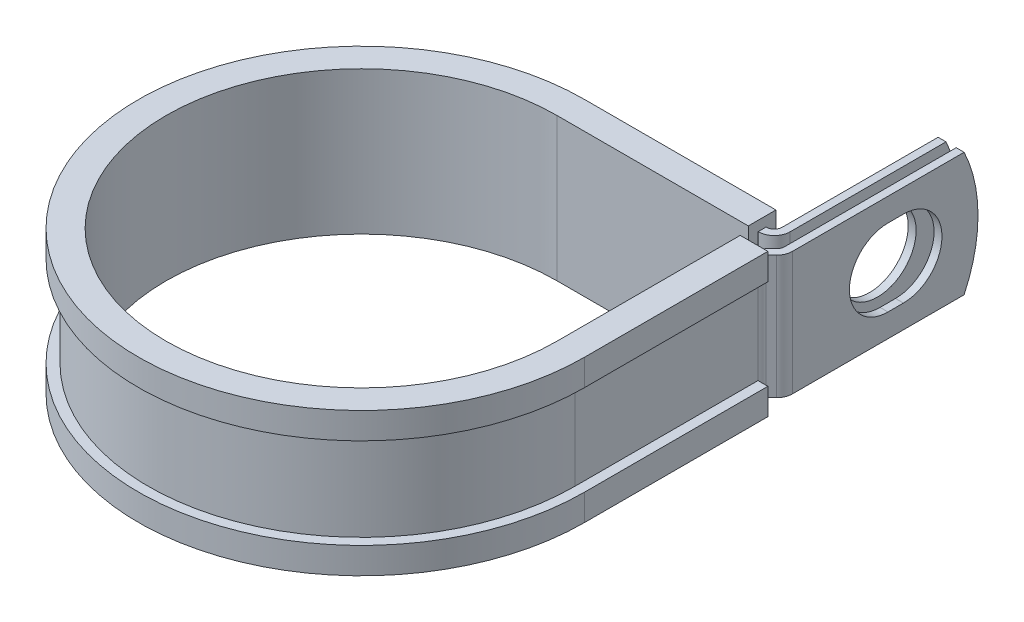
from build123d import *

# Parameters (mm, degrees)
EXTRUDE_THIN1_DEPTH = 9.525
SKETCH2_R           = 5.9436
CUT_EXTRUDE1_DEPTH  = 1.2192
CUT_EXTRUDE2_DEPTH  = 1.2192
CUT_EXTRUDE3_DEPTH  = 89.243807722


with BuildPart() as part:
    # Sketch1 → Extrude-Thin1 (new, symmetric)
    with BuildSketch(Plane(origin=(0, 0, 0), x_dir=(1, 0, 0), z_dir=(0, 1, 0))):
        with BuildLine():
            Line((33.5839698, 60.325), (33.5839698, 31.6865))
            ThreePointArc((33.5839698, 31.6865), (33.491163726, 31.219932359), (33.226874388, 30.824395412))
            Line((33.226874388, 30.824395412), (32.400690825, 29.998211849))
            ThreePointArc((32.400690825, 29.998211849), (31.872112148, 29.207137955), (31.6865, 28.274002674))
            Line((31.6865, 28.274002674), (31.6865, 0))
            ThreePointArc((31.6865, 0), (-22.405739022, -22.405739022), (0, 31.6865))
            Line((0, 31.6865), (29.5707698, 31.6865))
            ThreePointArc((29.5707698, 31.6865), (31.294978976, 32.400690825), (32.0091698, 34.1249))
            Line((32.0091698, 34.1249), (32.0091698, 60.325))
            Line((32.0091698, 60.325), (30.7899698, 60.325))
            Line((30.7899698, 60.325), (30.7899698, 34.1249))
            ThreePointArc((30.7899698, 34.1249), (30.432874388, 33.262795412), (29.5707698, 32.9057))
            Line((29.5707698, 32.9057), (0, 32.9057))
            ThreePointArc((0, 32.9057), (-23.26784361, -23.26784361), (32.9057, 0))
            Line((32.9057, 0), (32.9057, 28.274002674))
            ThreePointArc((32.9057, 28.274002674), (32.998506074, 28.740570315), (33.262795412, 29.136107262))
            Line((33.262795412, 29.136107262), (34.088978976, 29.962290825))
            ThreePointArc((34.088978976, 29.962290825), (34.617557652, 30.753364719), (34.8031698, 31.6865))
            Line((34.8031698, 31.6865), (34.8031698, 60.325))
            Line((34.8031698, 60.325), (33.5839698, 60.325))
        make_face()
    extrude(amount=EXTRUDE_THIN1_DEPTH, both=True)

    # Sketch2 → Cut-Extrude1 (cut)
    with BuildSketch(Plane.ZY.offset(-30.7899698)):
        with Locations((-47.625, 0)):
            Circle(SKETCH2_R)
    extrude(amount=-CUT_EXTRUDE1_DEPTH, mode=Mode.SUBTRACT)

    # Sketch3 → Cut-Extrude2 (cut)
    with BuildSketch(Plane(origin=(34.8031698, 0, 0), x_dir=(0, 0, -1), z_dir=(1, 0, 0))):
        with BuildLine():
            Line((46.4312, 5.9436), (48.8188, 5.9436))
            ThreePointArc((48.8188, 5.9436), (54.7624, 0), (48.8188, -5.9436))
            Line((48.8188, -5.9436), (46.4312, -5.9436))
            ThreePointArc((46.4312, -5.9436), (40.4876, 0), (46.4312, 5.9436))
        make_face()
    extrude(amount=-CUT_EXTRUDE2_DEPTH, mode=Mode.SUBTRACT)

    # Sketch4 → Cut-Extrude3 (cut, through all)
    with BuildSketch(Plane.ZY.offset(-30.7899698)):
        with BuildLine():
            Line((-58.180463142, 9.525), (-60.325, 9.525))
            Line((-60.325, 9.525), (-60.325, 0))
            ThreePointArc((-60.325, 0), (-59.782238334, 4.881717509), (-58.180463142, 9.525))
        make_face()
        with BuildLine():
            ThreePointArc((-58.180463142, -9.525), (-59.782238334, -4.881717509), (-60.325, 0))
            Line((-60.325, 0), (-60.325, -9.525))
            Line((-60.325, -9.525), (-58.180463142, -9.525))
        make_face()
    extrude(amount=-CUT_EXTRUDE3_DEPTH, mode=Mode.SUBTRACT)

    # Sweep1: sweep along a path in Sketch6
    with BuildLine(Plane(origin=(0, 9.525, 0), x_dir=(1, 0, 0), z_dir=(0, 1, 0))) as sweep1_path:
        Line((30.1625, 28.274002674), (30.1625, 0))
        ThreePointArc((30.1625, 0), (-21.328108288, -21.328108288), (0, 30.1625))
        Line((0, 30.1625), (29.5199698, 30.1625))
    # Sketch5 → Sweep1 (sweep)
    with BuildSketch(Plane(origin=(0, 0, -28.274002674), x_dir=(-1, 0, 0), z_dir=(0, 0, -1))):
        Polygon((-32.9057, 9.525), (-31.6865, 9.525), (-31.6865, -9.525), (-32.9057, -9.525), (-32.9057, -6.985), (-34.4297, -6.985), (-34.4297, -11.049), (-30.1625, -11.049), (-30.1625, 11.049), (-34.4297, 11.049), (-34.4297, 6.985), (-32.9057, 6.985), align=None)
    sweep(path=sweep1_path.line)


solid = part.part
